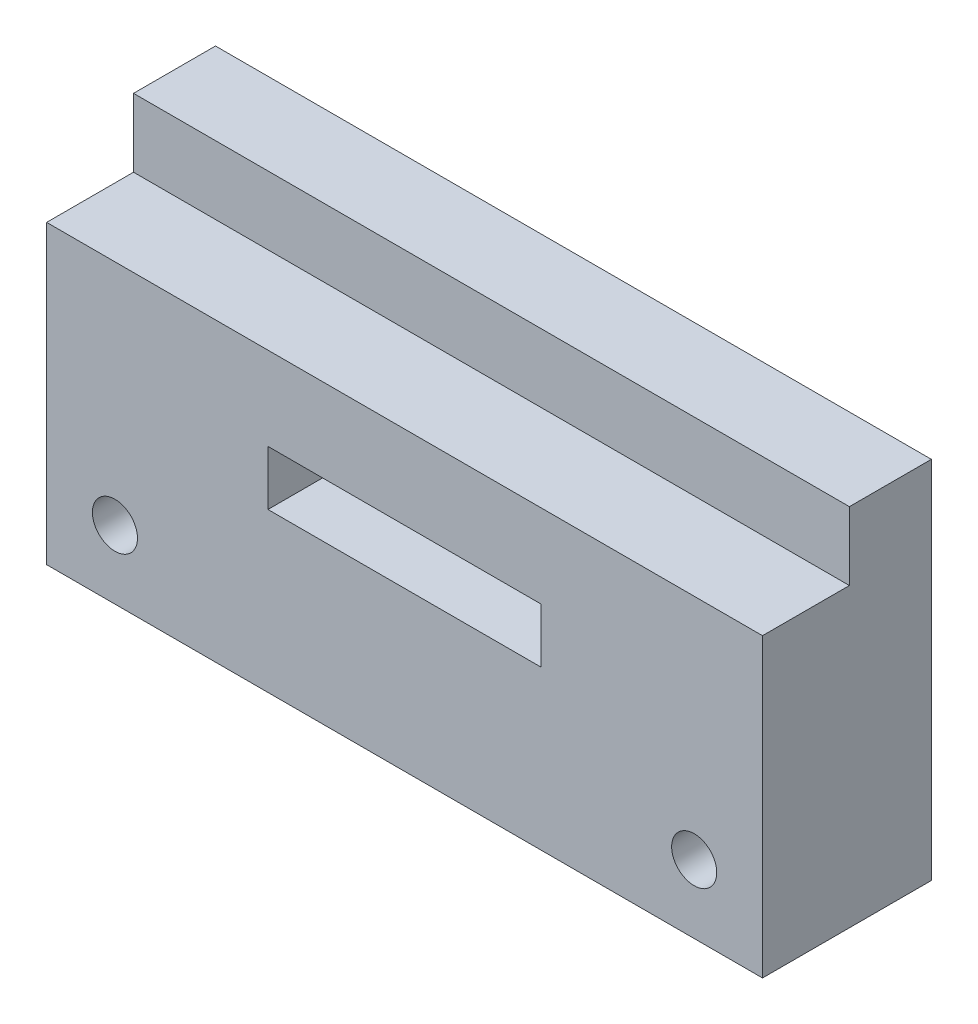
from build123d import *

# Parameters (mm, degrees)
SKETCH_1_W          = 52.4
SKETCH_1_H          = 26.7
SKETCH_1_R          = 1.65
SKETCH_1_W_2        = 20
SKETCH_1_H_2        = 4
EXTRUDE_1_DEPTH     = 12.36
SKETCH_2_OUTSIDE_W  = 26.38
SKETCH_2_OUTSIDE_H  = 40.72
CUT_EXTRUDE_1_DEPTH = 61.095087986


with BuildPart() as part:
    # Sketch 1 → Extrude 1 (new body)
    with BuildSketch(Plane.XY):
        with Locations((26.2, 13.35)):
            Rectangle(SKETCH_1_W, SKETCH_1_H)
        with Locations((5, 5)):
            Circle(SKETCH_1_R, mode=Mode.SUBTRACT)
        with Locations((47.4, 5)):
            Circle(SKETCH_1_R, mode=Mode.SUBTRACT)
        with Locations((26.2, 13.6)):
            Rectangle(SKETCH_1_W_2, SKETCH_1_H_2, mode=Mode.SUBTRACT)
    extrude(amount=EXTRUDE_1_DEPTH)

    # Sketch 2 outside → Cut-Extrude 1 (cut, through all)
    with BuildSketch(Plane(origin=(52.4, 0, 0), x_dir=(0, 0, -1), z_dir=(1, 0, 0))):
        with Locations((-6.18, 13.35)):
            Rectangle(SKETCH_2_OUTSIDE_W, SKETCH_2_OUTSIDE_H)
        Polygon((-12.36, 0), (-12.36, 21.7), (-6, 21.7), (-6, 26.7), (0, 26.7), (0, 0), align=None, mode=Mode.SUBTRACT)
    extrude(amount=-CUT_EXTRUDE_1_DEPTH, mode=Mode.SUBTRACT)


solid = part.part
